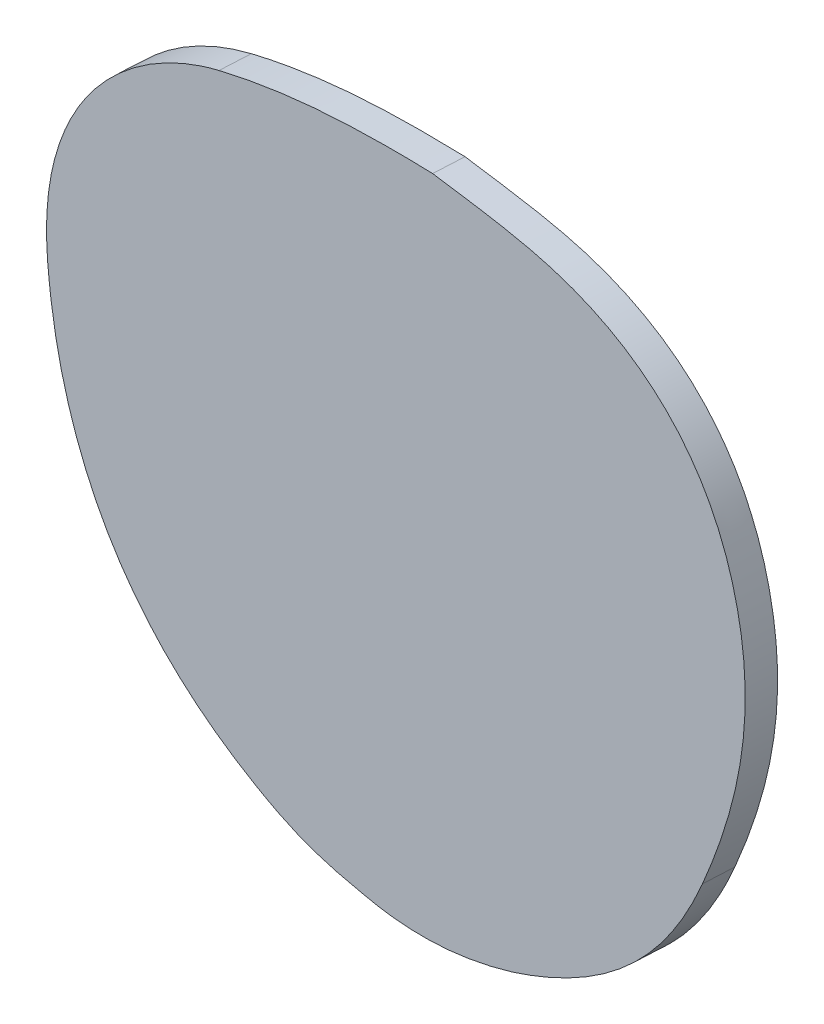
from build123d import *

# Parameters (mm, degrees)
BOSS_EXTRUDE1_DEPTH = 2


with BuildPart() as part:
    # Sketch1 → Boss-Extrude1 (new body)
    with BuildSketch(Plane(origin=(-1.378705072, 0, 26.307259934), x_dir=(-0.9986295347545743, 0, -0.05233595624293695), z_dir=(0.05233595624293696, -1.3976766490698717e-14, -0.9986295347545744))):
        with BuildLine():
            add(Edge.make_bspline(
                [(-57.946483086, 13.040870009), (-57.318950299, 13.130696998), (-56.693775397, 13.233275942), (-55.451748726, 13.48344714), (-54.834234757, 13.631666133), (-53.620634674, 13.992287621), (-53.022973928, 14.206402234), (-51.852144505, 14.691624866), (-51.278707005, 14.961129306), (-50.710279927, 15.241883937)],
                knots=[0, 0, 0, 0, 0.25, 0.25, 0.5, 0.5, 0.75, 0.75, 1, 1, 1, 1], degree=3))
            add(Edge.make_bspline(
                [(-50.710279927, 15.241883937), (-48.625986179, 16.271354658), (-46.690344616, 17.512371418), (-44.507043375, 19.399849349), (-44.081774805, 19.794766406), (-43.258692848, 20.618640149), (-42.078589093, 21.891980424), (-41.059726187, 23.276314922), (-39.840280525, 25.217804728), (-39.299430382, 26.237852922), (-38.354958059, 28.364674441), (-37.96142953, 29.447390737), (-36.979118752, 32.74417279), (-36.586734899, 35.006411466), (-36.38873715, 37.316329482)],
                knots=[0, 0, 0, 0, 0.25, 0.25, 0.3125, 0.3125, 0.375, 0.5, 0.5, 0.625, 0.625, 0.75, 0.75, 1, 1, 1, 1], degree=3))
            add(Edge.make_bspline(
                [(-36.38873715, 37.316329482), (-36.30863087, 38.250881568), (-36.29556748, 39.180798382), (-36.420566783, 41.030183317), (-36.558848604, 41.95113242), (-37.009770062, 43.774874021), (-37.315575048, 44.650340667), (-38.086549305, 46.329065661), (-38.552742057, 47.133934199), (-39.645418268, 48.662537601), (-40.255485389, 49.364330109), (-41.25731856, 50.331946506), (-41.605803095, 50.64022347), (-42.331389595, 51.228707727), (-42.709769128, 51.509625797), (-43.868478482, 52.297439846), (-44.676919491, 52.754513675), (-45.941203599, 53.342334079), (-46.371305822, 53.521842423), (-47.249434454, 53.846904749), (-47.697009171, 53.992181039), (-48.149434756, 54.118129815)],
                knots=[0, 0, 0, 0, 0.125, 0.125, 0.25, 0.25, 0.375, 0.375, 0.5, 0.5, 0.625, 0.625, 0.6875, 0.6875, 0.75, 0.75, 0.875, 0.875, 0.9375, 0.9375, 1, 1, 1, 1], degree=3))
            add(Edge.make_bspline(
                [(-48.149434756, 54.118129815), (-49.339829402, 54.449519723), (-50.541153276, 54.732631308), (-52.965408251, 55.203415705), (-54.187139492, 55.391026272), (-56.638615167, 55.68566926), (-57.870016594, 55.793264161), (-60.334277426, 55.949468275), (-61.568003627, 55.998334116), (-62.802825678, 56.027122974)],
                knots=[0, 0, 0, 0, 0.25, 0.25, 0.5, 0.5, 0.75, 0.75, 1, 1, 1, 1], degree=3))
            add(Edge.make_bspline(
                [(-62.802825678, 56.027122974), (-63.262904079, 55.978112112), (-63.723990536, 55.93904879), (-64.645889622, 55.858220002), (-65.10681574, 55.817574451), (-66.488599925, 55.685827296), (-67.409283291, 55.585280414), (-69.241756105, 55.330064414), (-70.151142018, 55.177570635), (-71.938723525, 54.759278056), (-72.818252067, 54.49832145), (-74.111447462, 54.012082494), (-74.538145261, 53.834137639), (-75.38173636, 53.442631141), (-75.796503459, 53.229860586), (-77.002633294, 52.545556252), (-77.762089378, 52.025367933), (-78.827191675, 51.138876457), (-79.170813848, 50.824672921), (-79.827662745, 50.162929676), (-80.137567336, 49.818926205), (-81.013782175, 48.748981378), (-81.526674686, 47.985163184), (-82.195768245, 46.768355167), (-82.402889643, 46.348842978), (-82.778902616, 45.500234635), (-82.948315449, 45.070669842), (-83.406283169, 43.767752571), (-83.644874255, 42.880264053), (-83.918827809, 41.525284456), (-83.995454, 41.069467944), (-84.118234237, 40.149213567), (-84.164102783, 39.686038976), (-84.254524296, 38.302375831), (-84.252649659, 37.38201008), (-84.134647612, 35.545095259), (-84.018254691, 34.627055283), (-83.684698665, 32.800633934), (-83.469851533, 31.902798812), (-82.710628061, 29.245976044), (-82.052496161, 27.523374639), (-81.306528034, 25.82886883)],
                knots=[0, 0, 0, 0, 0.03125, 0.03125, 0.0625, 0.0625, 0.125, 0.125, 0.1875, 0.1875, 0.25, 0.25, 0.28125, 0.28125, 0.3125, 0.3125, 0.375, 0.375, 0.40625, 0.40625, 0.4375, 0.4375, 0.5, 0.5, 0.53125, 0.53125, 0.5625, 0.5625, 0.625, 0.625, 0.65625, 0.65625, 0.6875, 0.6875, 0.75, 0.75, 0.8125, 0.8125, 0.875, 0.875, 1, 1, 1, 1], degree=3))
            add(Edge.make_bspline(
                [(-81.306528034, 25.82886883), (-80.693649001, 24.436684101), (-79.970100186, 23.106913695), (-78.664127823, 21.236697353), (-78.19551434, 20.639875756), (-77.198378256, 19.513088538), (-76.13874128, 18.449416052), (-74.954175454, 17.511897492), (-73.708875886, 16.635711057), (-73.066926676, 16.235908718), (-71.091403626, 15.135059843), (-69.708480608, 14.531924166), (-68.278177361, 14.022792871)],
                knots=[0, 0, 0, 0, 0.25, 0.25, 0.375, 0.375, 0.5, 0.625, 0.625, 0.75, 0.75, 1, 1, 1, 1], degree=3))
            add(Edge.make_bspline(
                [(-68.278177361, 14.022792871), (-67.447912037, 13.743092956), (-66.607300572, 13.50104999), (-64.900311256, 13.110746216), (-64.036514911, 12.963437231), (-62.296721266, 12.78245648), (-61.41912144, 12.74919197), (-59.677864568, 12.804740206), (-58.810576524, 12.893596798), (-57.946483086, 13.040870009)],
                knots=[0, 0, 0, 0, 0.25, 0.25, 0.5, 0.5, 0.75, 0.75, 1, 1, 1, 1], degree=3))
        make_face()
    extrude(amount=BOSS_EXTRUDE1_DEPTH)


solid = part.part
